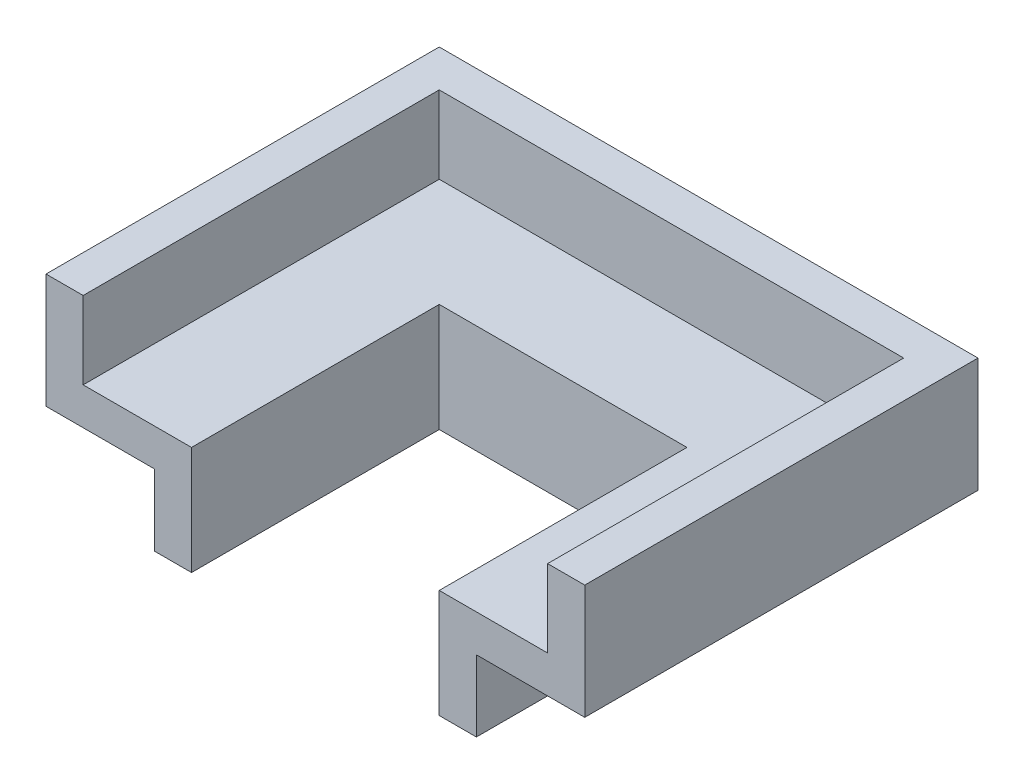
ISO-10303-21;
HEADER;
FILE_DESCRIPTION(('STEP AP214'),'2;1');
FILE_NAME('part.step','',(''),(''),'','','');
FILE_SCHEMA(('AUTOMOTIVE_DESIGN { 1 0 10303 214 1 1 1 1 }'));
ENDSEC;
DATA;
#1=APPLICATION_CONTEXT('core data for automotive mechanical design processes');
#2=APPLICATION_PROTOCOL_DEFINITION('international standard','automotive_design',2000,#1);
#3=PRODUCT_CONTEXT('',#1,'mechanical');
#4=PRODUCT('Part','Part','',(#3));
#5=PRODUCT_RELATED_PRODUCT_CATEGORY('part','',(#4));
#6=PRODUCT_DEFINITION_FORMATION('','',#4);
#7=PRODUCT_DEFINITION_CONTEXT('part definition',#1,'design');
#8=PRODUCT_DEFINITION('design','',#6,#7);
#9=PRODUCT_DEFINITION_SHAPE('','',#8);
#10=(LENGTH_UNIT() NAMED_UNIT(*) SI_UNIT(.MILLI.,.METRE.));
#11=(NAMED_UNIT(*) PLANE_ANGLE_UNIT() SI_UNIT($,.RADIAN.));
#12=(NAMED_UNIT(*) SI_UNIT($,.STERADIAN.) SOLID_ANGLE_UNIT());
#13=UNCERTAINTY_MEASURE_WITH_UNIT(LENGTH_MEASURE(1.E-05),#10,'distance_accuracy_value','');
#14=(GEOMETRIC_REPRESENTATION_CONTEXT(3) GLOBAL_UNCERTAINTY_ASSIGNED_CONTEXT((#13)) GLOBAL_UNIT_ASSIGNED_CONTEXT((#10,
#11,#12)) REPRESENTATION_CONTEXT('',''));
#15=CARTESIAN_POINT('',(0.,0.,0.));
#16=DIRECTION('',(0.,0.,1.));
#17=DIRECTION('',(1.,0.,0.));
#18=AXIS2_PLACEMENT_3D('',#15,#16,#17);
#19=CARTESIAN_POINT('',(-40.,0.,-80.));
#20=DIRECTION('',(1.,0.,0.));
#21=DIRECTION('',(0.,0.,-1.));
#22=AXIS2_PLACEMENT_3D('',#19,#20,#21);
#23=PLANE('',#22);
#24=DIRECTION('',(0.,0.,1.));
#25=VECTOR('',#24,1.);
#26=CARTESIAN_POINT('',(-40.,35.,-80.));
#27=LINE('',#26,#25);
#28=CARTESIAN_POINT('',(-40.,35.,-80.));
#29=VERTEX_POINT('',#28);
#30=CARTESIAN_POINT('',(-40.,35.,0.));
#31=VERTEX_POINT('',#30);
#32=EDGE_CURVE('E225',#29,#31,#27,.T.);
#33=ORIENTED_EDGE('',*,*,#32,.T.);
#34=DIRECTION('',(0.,-1.,0.));
#35=VECTOR('',#34,1.);
#36=CARTESIAN_POINT('',(-40.,0.,0.));
#37=LINE('',#36,#35);
#38=CARTESIAN_POINT('',(-40.,0.,0.));
#39=VERTEX_POINT('',#38);
#40=EDGE_CURVE('E251',#31,#39,#37,.T.);
#41=ORIENTED_EDGE('',*,*,#40,.T.);
#42=DIRECTION('',(0.,0.,1.));
#43=VECTOR('',#42,1.);
#44=CARTESIAN_POINT('',(-40.,0.,-80.));
#45=LINE('',#44,#43);
#46=CARTESIAN_POINT('',(-40.,0.,-80.));
#47=VERTEX_POINT('',#46);
#48=EDGE_CURVE('E229',#47,#39,#45,.T.);
#49=ORIENTED_EDGE('',*,*,#48,.F.);
#50=DIRECTION('',(0.,1.,0.));
#51=VECTOR('',#50,1.);
#52=CARTESIAN_POINT('',(-40.,0.,-80.));
#53=LINE('',#52,#51);
#54=EDGE_CURVE('E226',#47,#29,#53,.T.);
#55=ORIENTED_EDGE('',*,*,#54,.T.);
#56=EDGE_LOOP('',(#33,#41,#49,#55));
#57=FACE_BOUND('',#56,.T.);
#58=ADVANCED_FACE('F30',(#57),#23,.T.);
#59=CARTESIAN_POINT('',(-52.,0.,-92.));
#60=DIRECTION('',(-1.,0.,0.));
#61=DIRECTION('',(0.,0.,1.));
#62=AXIS2_PLACEMENT_3D('',#59,#60,#61);
#63=PLANE('',#62);
#64=DIRECTION('',(0.,0.,1.));
#65=VECTOR('',#64,1.);
#66=CARTESIAN_POINT('',(-52.,0.,-92.));
#67=LINE('',#66,#65);
#68=CARTESIAN_POINT('',(-52.,0.,-92.));
#69=VERTEX_POINT('',#68);
#70=CARTESIAN_POINT('',(-52.,0.,0.));
#71=VERTEX_POINT('',#70);
#72=EDGE_CURVE('E232',#69,#71,#67,.T.);
#73=ORIENTED_EDGE('',*,*,#72,.T.);
#74=DIRECTION('',(0.,1.,0.));
#75=VECTOR('',#74,1.);
#76=CARTESIAN_POINT('',(-52.,0.,0.));
#77=LINE('',#76,#75);
#78=CARTESIAN_POINT('',(-52.,23.,0.));
#79=VERTEX_POINT('',#78);
#80=EDGE_CURVE('E285',#71,#79,#77,.T.);
#81=ORIENTED_EDGE('',*,*,#80,.T.);
#82=DIRECTION('',(0.,0.,1.));
#83=VECTOR('',#82,1.);
#84=CARTESIAN_POINT('',(-52.,23.,-92.));
#85=LINE('',#84,#83);
#86=CARTESIAN_POINT('',(-52.,23.,-92.));
#87=VERTEX_POINT('',#86);
#88=EDGE_CURVE('E235',#87,#79,#85,.T.);
#89=ORIENTED_EDGE('',*,*,#88,.F.);
#90=DIRECTION('',(0.,-1.,0.));
#91=VECTOR('',#90,1.);
#92=CARTESIAN_POINT('',(-52.,0.,-92.));
#93=LINE('',#92,#91);
#94=EDGE_CURVE('E260',#87,#69,#93,.T.);
#95=ORIENTED_EDGE('',*,*,#94,.T.);
#96=EDGE_LOOP('',(#73,#81,#89,#95));
#97=FACE_BOUND('',#96,.T.);
#98=ADVANCED_FACE('F299',(#97),#63,.T.);
#99=CARTESIAN_POINT('',(-87.,23.,-127.));
#100=DIRECTION('',(-1.,0.,0.));
#101=DIRECTION('',(0.,0.,1.));
#102=AXIS2_PLACEMENT_3D('',#99,#100,#101);
#103=PLANE('',#102);
#104=DIRECTION('',(0.,0.,1.));
#105=VECTOR('',#104,1.);
#106=CARTESIAN_POINT('',(-87.,23.,-127.));
#107=LINE('',#106,#105);
#108=CARTESIAN_POINT('',(-87.,23.,-127.));
#109=VERTEX_POINT('',#108);
#110=CARTESIAN_POINT('',(-87.,23.,0.));
#111=VERTEX_POINT('',#110);
#112=EDGE_CURVE('E238',#109,#111,#107,.T.);
#113=ORIENTED_EDGE('',*,*,#112,.T.);
#114=DIRECTION('',(0.,1.,0.));
#115=VECTOR('',#114,1.);
#116=CARTESIAN_POINT('',(-87.,23.,0.));
#117=LINE('',#116,#115);
#118=CARTESIAN_POINT('',(-87.,60.,0.));
#119=VERTEX_POINT('',#118);
#120=EDGE_CURVE('E39',#111,#119,#117,.T.);
#121=ORIENTED_EDGE('',*,*,#120,.T.);
#122=DIRECTION('',(0.,0.,1.));
#123=VECTOR('',#122,1.);
#124=CARTESIAN_POINT('',(-87.,60.,-127.));
#125=LINE('',#124,#123);
#126=CARTESIAN_POINT('',(-87.,60.,-127.));
#127=VERTEX_POINT('',#126);
#128=EDGE_CURVE('E241',#127,#119,#125,.T.);
#129=ORIENTED_EDGE('',*,*,#128,.F.);
#130=DIRECTION('',(0.,-1.,0.));
#131=VECTOR('',#130,1.);
#132=CARTESIAN_POINT('',(-87.,23.,-127.));
#133=LINE('',#132,#131);
#134=EDGE_CURVE('E221',#127,#109,#133,.T.);
#135=ORIENTED_EDGE('',*,*,#134,.T.);
#136=EDGE_LOOP('',(#113,#121,#129,#135));
#137=FACE_BOUND('',#136,.T.);
#138=ADVANCED_FACE('F293',(#137),#103,.T.);
#139=CARTESIAN_POINT('',(-75.,35.,-115.));
#140=DIRECTION('',(1.,0.,0.));
#141=DIRECTION('',(0.,0.,-1.));
#142=AXIS2_PLACEMENT_3D('',#139,#140,#141);
#143=PLANE('',#142);
#144=DIRECTION('',(0.,0.,1.));
#145=VECTOR('',#144,1.);
#146=CARTESIAN_POINT('',(-75.,60.,-115.));
#147=LINE('',#146,#145);
#148=CARTESIAN_POINT('',(-75.,60.,-115.));
#149=VERTEX_POINT('',#148);
#150=CARTESIAN_POINT('',(-75.,60.,0.));
#151=VERTEX_POINT('',#150);
#152=EDGE_CURVE('E243',#149,#151,#147,.T.);
#153=ORIENTED_EDGE('',*,*,#152,.T.);
#154=DIRECTION('',(0.,-1.,0.));
#155=VECTOR('',#154,1.);
#156=CARTESIAN_POINT('',(-75.,35.,0.));
#157=LINE('',#156,#155);
#158=CARTESIAN_POINT('',(-75.,35.,0.));
#159=VERTEX_POINT('',#158);
#160=EDGE_CURVE('E34',#151,#159,#157,.T.);
#161=ORIENTED_EDGE('',*,*,#160,.T.);
#162=DIRECTION('',(0.,0.,1.));
#163=VECTOR('',#162,1.);
#164=CARTESIAN_POINT('',(-75.,35.,-115.));
#165=LINE('',#164,#163);
#166=CARTESIAN_POINT('',(-75.,35.,-115.));
#167=VERTEX_POINT('',#166);
#168=EDGE_CURVE('E245',#167,#159,#165,.T.);
#169=ORIENTED_EDGE('',*,*,#168,.F.);
#170=DIRECTION('',(0.,1.,0.));
#171=VECTOR('',#170,1.);
#172=CARTESIAN_POINT('',(-75.,35.,-115.));
#173=LINE('',#172,#171);
#174=EDGE_CURVE('E222',#167,#149,#173,.T.);
#175=ORIENTED_EDGE('',*,*,#174,.T.);
#176=EDGE_LOOP('',(#153,#161,#169,#175));
#177=FACE_BOUND('',#176,.T.);
#178=ADVANCED_FACE('F32',(#177),#143,.T.);
#179=CARTESIAN_POINT('',(40.,0.,-80.));
#180=DIRECTION('',(0.,0.,-1.));
#181=DIRECTION('',(-1.,0.,0.));
#182=AXIS2_PLACEMENT_3D('',#179,#180,#181);
#183=PLANE('',#182);
#184=ORIENTED_EDGE('',*,*,#54,.F.);
#185=DIRECTION('',(-1.,0.,0.));
#186=VECTOR('',#185,1.);
#187=CARTESIAN_POINT('',(40.,0.,-80.));
#188=LINE('',#187,#186);
#189=CARTESIAN_POINT('',(40.,0.,-80.));
#190=VERTEX_POINT('',#189);
#191=EDGE_CURVE('E202',#190,#47,#188,.T.);
#192=ORIENTED_EDGE('',*,*,#191,.F.);
#193=DIRECTION('',(0.,-1.,0.));
#194=VECTOR('',#193,1.);
#195=CARTESIAN_POINT('',(40.,0.,-80.));
#196=LINE('',#195,#194);
#197=CARTESIAN_POINT('',(40.,35.,-80.));
#198=VERTEX_POINT('',#197);
#199=EDGE_CURVE('E169',#198,#190,#196,.T.);
#200=ORIENTED_EDGE('',*,*,#199,.F.);
#201=DIRECTION('',(-1.,0.,0.));
#202=VECTOR('',#201,1.);
#203=CARTESIAN_POINT('',(40.,35.,-80.));
#204=LINE('',#203,#202);
#205=EDGE_CURVE('E199',#198,#29,#204,.T.);
#206=ORIENTED_EDGE('',*,*,#205,.T.);
#207=EDGE_LOOP('',(#184,#192,#200,#206));
#208=FACE_BOUND('',#207,.T.);
#209=ADVANCED_FACE('F281',(#208),#183,.F.);
#210=CARTESIAN_POINT('',(52.,0.,-92.));
#211=DIRECTION('',(0.,0.,1.));
#212=DIRECTION('',(1.,0.,0.));
#213=AXIS2_PLACEMENT_3D('',#210,#211,#212);
#214=PLANE('',#213);
#215=ORIENTED_EDGE('',*,*,#94,.F.);
#216=DIRECTION('',(-1.,0.,0.));
#217=VECTOR('',#216,1.);
#218=CARTESIAN_POINT('',(52.,23.,-92.));
#219=LINE('',#218,#217);
#220=CARTESIAN_POINT('',(52.,23.,-92.));
#221=VERTEX_POINT('',#220);
#222=EDGE_CURVE('E206',#221,#87,#219,.T.);
#223=ORIENTED_EDGE('',*,*,#222,.F.);
#224=DIRECTION('',(0.,1.,0.));
#225=VECTOR('',#224,1.);
#226=CARTESIAN_POINT('',(52.,0.,-92.));
#227=LINE('',#226,#225);
#228=CARTESIAN_POINT('',(52.,0.,-92.));
#229=VERTEX_POINT('',#228);
#230=EDGE_CURVE('E187',#229,#221,#227,.T.);
#231=ORIENTED_EDGE('',*,*,#230,.F.);
#232=DIRECTION('',(-1.,0.,0.));
#233=VECTOR('',#232,1.);
#234=CARTESIAN_POINT('',(52.,0.,-92.));
#235=LINE('',#234,#233);
#236=EDGE_CURVE('E148',#229,#69,#235,.T.);
#237=ORIENTED_EDGE('',*,*,#236,.T.);
#238=EDGE_LOOP('',(#215,#223,#231,#237));
#239=FACE_BOUND('',#238,.T.);
#240=ADVANCED_FACE('F301',(#239),#214,.F.);
#241=CARTESIAN_POINT('',(87.,23.,-127.));
#242=DIRECTION('',(0.,0.,1.));
#243=DIRECTION('',(1.,0.,0.));
#244=AXIS2_PLACEMENT_3D('',#241,#242,#243);
#245=PLANE('',#244);
#246=ORIENTED_EDGE('',*,*,#134,.F.);
#247=DIRECTION('',(-1.,0.,0.));
#248=VECTOR('',#247,1.);
#249=CARTESIAN_POINT('',(87.,60.,-127.));
#250=LINE('',#249,#248);
#251=CARTESIAN_POINT('',(87.,60.,-127.));
#252=VERTEX_POINT('',#251);
#253=EDGE_CURVE('E212',#252,#127,#250,.T.);
#254=ORIENTED_EDGE('',*,*,#253,.F.);
#255=DIRECTION('',(0.,1.,0.));
#256=VECTOR('',#255,1.);
#257=CARTESIAN_POINT('',(87.,23.,-127.));
#258=LINE('',#257,#256);
#259=CARTESIAN_POINT('',(87.,23.,-127.));
#260=VERTEX_POINT('',#259);
#261=EDGE_CURVE('E266',#260,#252,#258,.T.);
#262=ORIENTED_EDGE('',*,*,#261,.F.);
#263=DIRECTION('',(-1.,0.,0.));
#264=VECTOR('',#263,1.);
#265=CARTESIAN_POINT('',(87.,23.,-127.));
#266=LINE('',#265,#264);
#267=EDGE_CURVE('E209',#260,#109,#266,.T.);
#268=ORIENTED_EDGE('',*,*,#267,.T.);
#269=EDGE_LOOP('',(#246,#254,#262,#268));
#270=FACE_BOUND('',#269,.T.);
#271=ADVANCED_FACE('F320',(#270),#245,.F.);
#272=CARTESIAN_POINT('',(75.,35.,-115.));
#273=DIRECTION('',(0.,0.,-1.));
#274=DIRECTION('',(-1.,0.,0.));
#275=AXIS2_PLACEMENT_3D('',#272,#273,#274);
#276=PLANE('',#275);
#277=ORIENTED_EDGE('',*,*,#174,.F.);
#278=DIRECTION('',(-1.,0.,0.));
#279=VECTOR('',#278,1.);
#280=CARTESIAN_POINT('',(75.,35.,-115.));
#281=LINE('',#280,#279);
#282=CARTESIAN_POINT('',(75.,35.,-115.));
#283=VERTEX_POINT('',#282);
#284=EDGE_CURVE('E218',#283,#167,#281,.T.);
#285=ORIENTED_EDGE('',*,*,#284,.F.);
#286=DIRECTION('',(0.,-1.,0.));
#287=VECTOR('',#286,1.);
#288=CARTESIAN_POINT('',(75.,35.,-115.));
#289=LINE('',#288,#287);
#290=CARTESIAN_POINT('',(75.,60.,-115.));
#291=VERTEX_POINT('',#290);
#292=EDGE_CURVE('E268',#291,#283,#289,.T.);
#293=ORIENTED_EDGE('',*,*,#292,.F.);
#294=DIRECTION('',(-1.,0.,0.));
#295=VECTOR('',#294,1.);
#296=CARTESIAN_POINT('',(75.,60.,-115.));
#297=LINE('',#296,#295);
#298=EDGE_CURVE('E215',#291,#149,#297,.T.);
#299=ORIENTED_EDGE('',*,*,#298,.T.);
#300=EDGE_LOOP('',(#277,#285,#293,#299));
#301=FACE_BOUND('',#300,.T.);
#302=ADVANCED_FACE('F318',(#301),#276,.F.);
#303=CARTESIAN_POINT('',(52.,0.,0.));
#304=DIRECTION('',(0.,0.,1.));
#305=DIRECTION('',(1.,0.,0.));
#306=AXIS2_PLACEMENT_3D('',#303,#304,#305);
#307=PLANE('',#306);
#308=DIRECTION('',(1.,0.,0.));
#309=VECTOR('',#308,1.);
#310=CARTESIAN_POINT('',(40.,0.,0.));
#311=LINE('',#310,#309);
#312=CARTESIAN_POINT('',(40.,0.,0.));
#313=VERTEX_POINT('',#312);
#314=CARTESIAN_POINT('',(52.,0.,0.));
#315=VERTEX_POINT('',#314);
#316=EDGE_CURVE('E145',#313,#315,#311,.T.);
#317=ORIENTED_EDGE('',*,*,#316,.T.);
#318=DIRECTION('',(0.,1.,0.));
#319=VECTOR('',#318,1.);
#320=CARTESIAN_POINT('',(52.,0.,0.));
#321=LINE('',#320,#319);
#322=CARTESIAN_POINT('',(52.,23.,0.));
#323=VERTEX_POINT('',#322);
#324=EDGE_CURVE('E156',#315,#323,#321,.T.);
#325=ORIENTED_EDGE('',*,*,#324,.T.);
#326=DIRECTION('',(1.,0.,0.));
#327=VECTOR('',#326,1.);
#328=CARTESIAN_POINT('',(52.,23.,0.));
#329=LINE('',#328,#327);
#330=CARTESIAN_POINT('',(87.,23.,0.));
#331=VERTEX_POINT('',#330);
#332=EDGE_CURVE('E162',#323,#331,#329,.T.);
#333=ORIENTED_EDGE('',*,*,#332,.T.);
#334=DIRECTION('',(0.,1.,0.));
#335=VECTOR('',#334,1.);
#336=CARTESIAN_POINT('',(87.,23.,0.));
#337=LINE('',#336,#335);
#338=CARTESIAN_POINT('',(87.,60.,0.));
#339=VERTEX_POINT('',#338);
#340=EDGE_CURVE('E173',#331,#339,#337,.T.);
#341=ORIENTED_EDGE('',*,*,#340,.T.);
#342=DIRECTION('',(-1.,0.,0.));
#343=VECTOR('',#342,1.);
#344=CARTESIAN_POINT('',(75.,60.,0.));
#345=LINE('',#344,#343);
#346=CARTESIAN_POINT('',(75.,60.,0.));
#347=VERTEX_POINT('',#346);
#348=EDGE_CURVE('E176',#339,#347,#345,.T.);
#349=ORIENTED_EDGE('',*,*,#348,.T.);
#350=DIRECTION('',(0.,-1.,0.));
#351=VECTOR('',#350,1.);
#352=CARTESIAN_POINT('',(75.,35.,0.));
#353=LINE('',#352,#351);
#354=CARTESIAN_POINT('',(75.,35.,0.));
#355=VERTEX_POINT('',#354);
#356=EDGE_CURVE('E179',#347,#355,#353,.T.);
#357=ORIENTED_EDGE('',*,*,#356,.T.);
#358=DIRECTION('',(-1.,0.,0.));
#359=VECTOR('',#358,1.);
#360=CARTESIAN_POINT('',(40.,35.,0.));
#361=LINE('',#360,#359);
#362=CARTESIAN_POINT('',(40.,35.,0.));
#363=VERTEX_POINT('',#362);
#364=EDGE_CURVE('E182',#355,#363,#361,.T.);
#365=ORIENTED_EDGE('',*,*,#364,.T.);
#366=DIRECTION('',(0.,-1.,0.));
#367=VECTOR('',#366,1.);
#368=CARTESIAN_POINT('',(40.,0.,0.));
#369=LINE('',#368,#367);
#370=EDGE_CURVE('E153',#363,#313,#369,.T.);
#371=ORIENTED_EDGE('',*,*,#370,.T.);
#372=EDGE_LOOP('',(#317,#325,#333,#341,#349,#357,#365,#371));
#373=FACE_BOUND('',#372,.T.);
#374=ADVANCED_FACE('F164',(#373),#307,.T.);
#375=CARTESIAN_POINT('',(40.,0.,-179.716796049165));
#376=DIRECTION('',(0.,-1.,0.));
#377=DIRECTION('',(0.,0.,-1.));
#378=AXIS2_PLACEMENT_3D('',#375,#376,#377);
#379=PLANE('',#378);
#380=DIRECTION('',(0.,0.,1.));
#381=VECTOR('',#380,1.);
#382=CARTESIAN_POINT('',(40.,0.,-179.716796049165));
#383=LINE('',#382,#381);
#384=EDGE_CURVE('E185',#190,#313,#383,.T.);
#385=ORIENTED_EDGE('',*,*,#384,.F.);
#386=ORIENTED_EDGE('',*,*,#191,.T.);
#387=ORIENTED_EDGE('',*,*,#48,.T.);
#388=DIRECTION('',(-1.,0.,0.));
#389=VECTOR('',#388,1.);
#390=CARTESIAN_POINT('',(0.,0.,0.));
#391=LINE('',#390,#389);
#392=EDGE_CURVE('E254',#39,#71,#391,.T.);
#393=ORIENTED_EDGE('',*,*,#392,.T.);
#394=ORIENTED_EDGE('',*,*,#72,.F.);
#395=ORIENTED_EDGE('',*,*,#236,.F.);
#396=DIRECTION('',(0.,0.,1.));
#397=VECTOR('',#396,1.);
#398=CARTESIAN_POINT('',(52.,0.,-179.716796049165));
#399=LINE('',#398,#397);
#400=EDGE_CURVE('E140',#229,#315,#399,.T.);
#401=ORIENTED_EDGE('',*,*,#400,.T.);
#402=ORIENTED_EDGE('',*,*,#316,.F.);
#403=EDGE_LOOP('',(#385,#386,#387,#393,#394,#395,#401,#402));
#404=FACE_BOUND('',#403,.T.);
#405=ADVANCED_FACE('F143',(#404),#379,.T.);
#406=CARTESIAN_POINT('',(52.,0.,-179.716796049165));
#407=DIRECTION('',(1.,0.,0.));
#408=DIRECTION('',(0.,0.,-1.));
#409=AXIS2_PLACEMENT_3D('',#406,#407,#408);
#410=PLANE('',#409);
#411=ORIENTED_EDGE('',*,*,#400,.F.);
#412=ORIENTED_EDGE('',*,*,#230,.T.);
#413=DIRECTION('',(0.,0.,1.));
#414=VECTOR('',#413,1.);
#415=CARTESIAN_POINT('',(52.,23.,-179.716796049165));
#416=LINE('',#415,#414);
#417=EDGE_CURVE('E152',#221,#323,#416,.T.);
#418=ORIENTED_EDGE('',*,*,#417,.T.);
#419=ORIENTED_EDGE('',*,*,#324,.F.);
#420=EDGE_LOOP('',(#411,#412,#418,#419));
#421=FACE_BOUND('',#420,.T.);
#422=ADVANCED_FACE('F157',(#421),#410,.T.);
#423=CARTESIAN_POINT('',(52.,23.,-179.716796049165));
#424=DIRECTION('',(0.,-1.,0.));
#425=DIRECTION('',(0.,0.,-1.));
#426=AXIS2_PLACEMENT_3D('',#423,#424,#425);
#427=PLANE('',#426);
#428=ORIENTED_EDGE('',*,*,#417,.F.);
#429=ORIENTED_EDGE('',*,*,#222,.T.);
#430=ORIENTED_EDGE('',*,*,#88,.T.);
#431=DIRECTION('',(-1.,0.,0.));
#432=VECTOR('',#431,1.);
#433=CARTESIAN_POINT('',(0.,23.,0.));
#434=LINE('',#433,#432);
#435=EDGE_CURVE('E286',#79,#111,#434,.T.);
#436=ORIENTED_EDGE('',*,*,#435,.T.);
#437=ORIENTED_EDGE('',*,*,#112,.F.);
#438=ORIENTED_EDGE('',*,*,#267,.F.);
#439=DIRECTION('',(0.,0.,1.));
#440=VECTOR('',#439,1.);
#441=CARTESIAN_POINT('',(87.,23.,-179.716796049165));
#442=LINE('',#441,#440);
#443=EDGE_CURVE('E196',#260,#331,#442,.T.);
#444=ORIENTED_EDGE('',*,*,#443,.T.);
#445=ORIENTED_EDGE('',*,*,#332,.F.);
#446=EDGE_LOOP('',(#428,#429,#430,#436,#437,#438,#444,#445));
#447=FACE_BOUND('',#446,.T.);
#448=ADVANCED_FACE('F296',(#447),#427,.T.);
#449=CARTESIAN_POINT('',(87.,23.,-179.716796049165));
#450=DIRECTION('',(1.,0.,0.));
#451=DIRECTION('',(0.,0.,-1.));
#452=AXIS2_PLACEMENT_3D('',#449,#450,#451);
#453=PLANE('',#452);
#454=ORIENTED_EDGE('',*,*,#443,.F.);
#455=ORIENTED_EDGE('',*,*,#261,.T.);
#456=DIRECTION('',(0.,0.,1.));
#457=VECTOR('',#456,1.);
#458=CARTESIAN_POINT('',(87.,60.,-179.716796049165));
#459=LINE('',#458,#457);
#460=EDGE_CURVE('E194',#252,#339,#459,.T.);
#461=ORIENTED_EDGE('',*,*,#460,.T.);
#462=ORIENTED_EDGE('',*,*,#340,.F.);
#463=EDGE_LOOP('',(#454,#455,#461,#462));
#464=FACE_BOUND('',#463,.T.);
#465=ADVANCED_FACE('F306',(#464),#453,.T.);
#466=CARTESIAN_POINT('',(75.,60.,-179.716796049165));
#467=DIRECTION('',(0.,1.,0.));
#468=DIRECTION('',(0.,0.,1.));
#469=AXIS2_PLACEMENT_3D('',#466,#467,#468);
#470=PLANE('',#469);
#471=ORIENTED_EDGE('',*,*,#460,.F.);
#472=ORIENTED_EDGE('',*,*,#253,.T.);
#473=ORIENTED_EDGE('',*,*,#128,.T.);
#474=DIRECTION('',(1.,0.,0.));
#475=VECTOR('',#474,1.);
#476=CARTESIAN_POINT('',(0.,60.,0.));
#477=LINE('',#476,#475);
#478=EDGE_CURVE('E12',#119,#151,#477,.T.);
#479=ORIENTED_EDGE('',*,*,#478,.T.);
#480=ORIENTED_EDGE('',*,*,#152,.F.);
#481=ORIENTED_EDGE('',*,*,#298,.F.);
#482=DIRECTION('',(0.,0.,1.));
#483=VECTOR('',#482,1.);
#484=CARTESIAN_POINT('',(75.,60.,-179.716796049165));
#485=LINE('',#484,#483);
#486=EDGE_CURVE('E192',#291,#347,#485,.T.);
#487=ORIENTED_EDGE('',*,*,#486,.T.);
#488=ORIENTED_EDGE('',*,*,#348,.F.);
#489=EDGE_LOOP('',(#471,#472,#473,#479,#480,#481,#487,#488));
#490=FACE_BOUND('',#489,.T.);
#491=ADVANCED_FACE('F310',(#490),#470,.T.);
#492=CARTESIAN_POINT('',(75.,35.,-179.716796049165));
#493=DIRECTION('',(-1.,0.,0.));
#494=DIRECTION('',(0.,0.,1.));
#495=AXIS2_PLACEMENT_3D('',#492,#493,#494);
#496=PLANE('',#495);
#497=ORIENTED_EDGE('',*,*,#486,.F.);
#498=ORIENTED_EDGE('',*,*,#292,.T.);
#499=DIRECTION('',(0.,0.,1.));
#500=VECTOR('',#499,1.);
#501=CARTESIAN_POINT('',(75.,35.,-179.716796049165));
#502=LINE('',#501,#500);
#503=EDGE_CURVE('E190',#283,#355,#502,.T.);
#504=ORIENTED_EDGE('',*,*,#503,.T.);
#505=ORIENTED_EDGE('',*,*,#356,.F.);
#506=EDGE_LOOP('',(#497,#498,#504,#505));
#507=FACE_BOUND('',#506,.T.);
#508=ADVANCED_FACE('F312',(#507),#496,.T.);
#509=CARTESIAN_POINT('',(40.,35.,-179.716796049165));
#510=DIRECTION('',(0.,1.,0.));
#511=DIRECTION('',(0.,0.,1.));
#512=AXIS2_PLACEMENT_3D('',#509,#510,#511);
#513=PLANE('',#512);
#514=ORIENTED_EDGE('',*,*,#503,.F.);
#515=ORIENTED_EDGE('',*,*,#284,.T.);
#516=ORIENTED_EDGE('',*,*,#168,.T.);
#517=DIRECTION('',(1.,0.,0.));
#518=VECTOR('',#517,1.);
#519=CARTESIAN_POINT('',(0.,35.,0.));
#520=LINE('',#519,#518);
#521=EDGE_CURVE('E249',#159,#31,#520,.T.);
#522=ORIENTED_EDGE('',*,*,#521,.T.);
#523=ORIENTED_EDGE('',*,*,#32,.F.);
#524=ORIENTED_EDGE('',*,*,#205,.F.);
#525=DIRECTION('',(0.,0.,1.));
#526=VECTOR('',#525,1.);
#527=CARTESIAN_POINT('',(40.,35.,-179.716796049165));
#528=LINE('',#527,#526);
#529=EDGE_CURVE('E188',#198,#363,#528,.T.);
#530=ORIENTED_EDGE('',*,*,#529,.T.);
#531=ORIENTED_EDGE('',*,*,#364,.F.);
#532=EDGE_LOOP('',(#514,#515,#516,#522,#523,#524,#530,#531));
#533=FACE_BOUND('',#532,.T.);
#534=ADVANCED_FACE('F315',(#533),#513,.T.);
#535=CARTESIAN_POINT('',(40.,0.,-179.716796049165));
#536=DIRECTION('',(-1.,0.,0.));
#537=DIRECTION('',(0.,0.,1.));
#538=AXIS2_PLACEMENT_3D('',#535,#536,#537);
#539=PLANE('',#538);
#540=ORIENTED_EDGE('',*,*,#529,.F.);
#541=ORIENTED_EDGE('',*,*,#199,.T.);
#542=ORIENTED_EDGE('',*,*,#384,.T.);
#543=ORIENTED_EDGE('',*,*,#370,.F.);
#544=EDGE_LOOP('',(#540,#541,#542,#543));
#545=FACE_BOUND('',#544,.T.);
#546=ADVANCED_FACE('F277',(#545),#539,.T.);
#547=CARTESIAN_POINT('',(-63.5,30.,0.));
#548=DIRECTION('',(0.,0.,1.));
#549=DIRECTION('',(1.,0.,0.));
#550=AXIS2_PLACEMENT_3D('',#547,#548,#549);
#551=PLANE('',#550);
#552=ORIENTED_EDGE('',*,*,#160,.F.);
#553=ORIENTED_EDGE('',*,*,#478,.F.);
#554=ORIENTED_EDGE('',*,*,#120,.F.);
#555=ORIENTED_EDGE('',*,*,#435,.F.);
#556=ORIENTED_EDGE('',*,*,#80,.F.);
#557=ORIENTED_EDGE('',*,*,#392,.F.);
#558=ORIENTED_EDGE('',*,*,#40,.F.);
#559=ORIENTED_EDGE('',*,*,#521,.F.);
#560=EDGE_LOOP('',(#552,#553,#554,#555,#556,#557,#558,#559));
#561=FACE_BOUND('',#560,.T.);
#562=ADVANCED_FACE('F283',(#561),#551,.T.);
#563=CLOSED_SHELL('',(#58,#98,#138,#178,#209,#240,#271,#302,#374,#405,#422,#448,#465,#491,#508,
#534,#546,#562));
#564=MANIFOLD_SOLID_BREP('B2',#563);
#565=ADVANCED_BREP_SHAPE_REPRESENTATION('',(#18,#564),#14);
#566=SHAPE_DEFINITION_REPRESENTATION(#9,#565);
ENDSEC;
END-ISO-10303-21;
